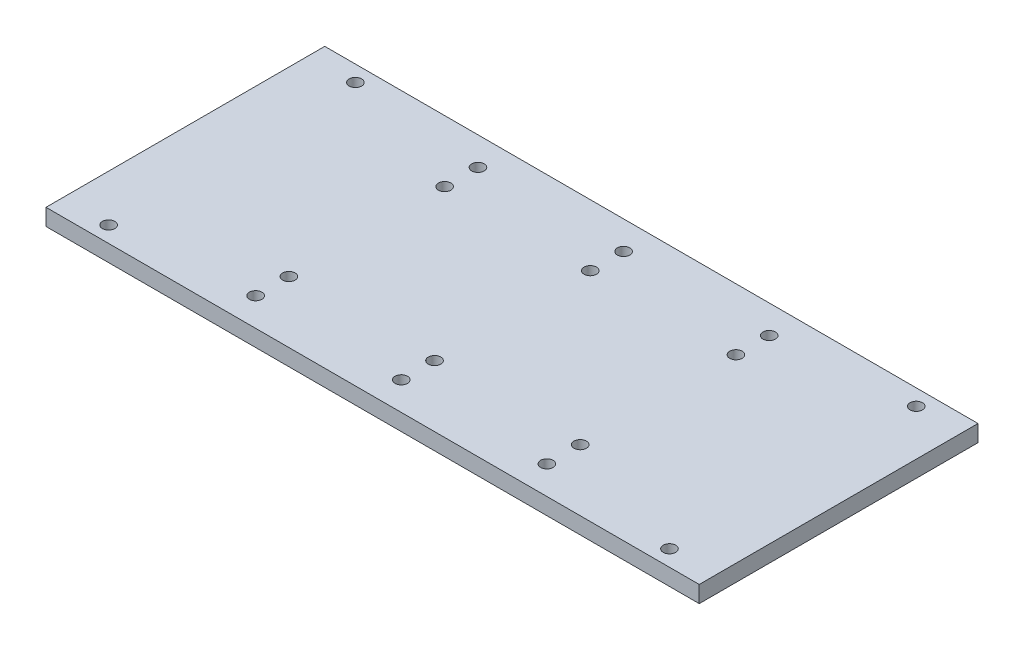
from build123d import *

# Parameters (mm, degrees)
SKETCH_1_W           = 157
SKETCH_1_H           = 67
EXTRUDE_1_DEPTH      = 4
SKETCH_9_R           = 1.5
CUT_EXTRUDE_8_DEPTH  = 20
SKETCH_10_R          = 1.5
CUT_EXTRUDE_9_DEPTH  = 20
SKETCH_11_R          = 1.5
CUT_EXTRUDE_10_DEPTH = 20
SKETCH_12_R          = 1.5
CUT_EXTRUDE_11_DEPTH = 20


with BuildPart() as part:
    # Sketch 1 → Extrude 1 (new body)
    with BuildSketch(Plane(origin=(0, 0, 0), x_dir=(1, 0, 0), z_dir=(0, 1, 0))):
        Rectangle(SKETCH_1_W, SKETCH_1_H)
    extrude(amount=EXTRUDE_1_DEPTH)

    # Sketch 9 → Cut-Extrude 8 (cut)
    with BuildSketch(Plane(origin=(-3.898881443, -3, 127.618121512), x_dir=(-1, 0, 0), z_dir=(0, -1, 0))):
        with Locations(Location((-71.398881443, 157.275798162, 0), (0, 0, 90))):
            Circle(SKETCH_9_R)
        with Locations(Location((63.398881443, 157.275798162, 0), (0, 0, 90))):
            Circle(SKETCH_9_R)
    extrude(amount=-CUT_EXTRUDE_8_DEPTH, mode=Mode.SUBTRACT)

    # Sketch 10 → Cut-Extrude 9 (cut)
    with BuildSketch(Plane(origin=(-3.898881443, 0, -151.797672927), x_dir=(1, 0, 0), z_dir=(0, -1, 0))):
        with Locations(Location((71.398881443, 181.455349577, 0), (0, 0, 270))):
            Circle(SKETCH_10_R)
        with Locations(Location((-63.398881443, 181.455349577, 0), (0, 0, 270))):
            Circle(SKETCH_10_R)
    extrude(amount=-CUT_EXTRUDE_9_DEPTH, mode=Mode.SUBTRACT)

    # Sketch 11 → Cut-Extrude 10 (cut)
    with BuildSketch(Plane(origin=(-3.898881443, 4, 127.618121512), x_dir=(1, 0, 0), z_dir=(0, 1, 0))):
        with Locations(Location((-31, 108.902731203, 0), (0, 0, 270))):
            Circle(SKETCH_11_R)
        with Locations(Location((4, 108.902731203, 0), (0, 0, 270))):
            Circle(SKETCH_11_R)
        with Locations(Location((39, 108.902731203, 0), (0, 0, 270))):
            Circle(SKETCH_11_R)
        with Locations(Location((-31, 100.902731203, 0), (0, 0, 270))):
            Circle(SKETCH_11_R)
        with Locations(Location((4, 100.902731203, 0), (0, 0, 270))):
            Circle(SKETCH_11_R)
        with Locations(Location((39, 100.902731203, 0), (0, 0, 270))):
            Circle(SKETCH_11_R)
    extrude(amount=-CUT_EXTRUDE_10_DEPTH, mode=Mode.SUBTRACT)

    # Sketch 12 → Cut-Extrude 11 (cut)
    with BuildSketch(Plane(origin=(0, 4, 0), x_dir=(1, 0, 0), z_dir=(0, 1, 0))):
        with Locations(Location((35.101118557, 18.715390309, 0), (0, 0, 270))):
            Circle(SKETCH_12_R)
        with Locations(Location((0.101118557, 18.715390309, 0), (0, 0, 270))):
            Circle(SKETCH_12_R)
        with Locations(Location((-34.898881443, 18.715390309, 0), (0, 0, 270))):
            Circle(SKETCH_12_R)
        with Locations(Location((-34.898881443, 26.715390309, 0), (0, 0, 270))):
            Circle(SKETCH_12_R)
        with Locations(Location((0.101118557, 26.715390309, 0), (0, 0, 270))):
            Circle(SKETCH_12_R)
        with Locations(Location((35.101118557, 26.715390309, 0), (0, 0, 270))):
            Circle(SKETCH_12_R)
    extrude(amount=-CUT_EXTRUDE_11_DEPTH, mode=Mode.SUBTRACT)


solid = part.part
